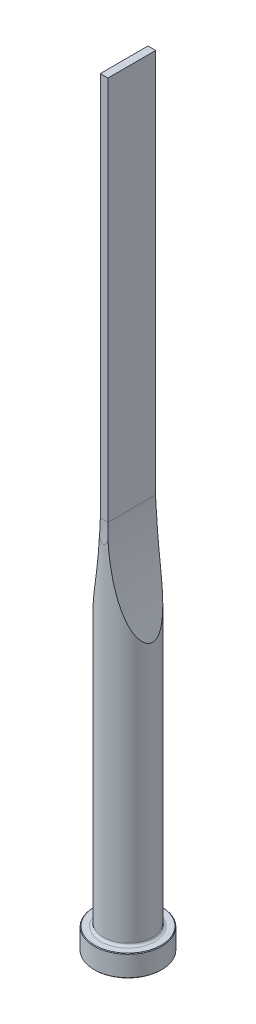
from build123d import *

# Parameters (mm, degrees)
CUT_EXTRUDE1_DEPTH = 10
CUT_EXTRUDE2_DEPTH = 10


with BuildPart() as part:
    # Sketch1 → Revolve1 (revolve)
    with BuildSketch(Plane.XY, mode=Mode.PRIVATE) as revolve1_sk:
        with BuildLine():
            Line((0, 0), (10.8, 0))
            Line((10.8, 0), (11, 0.2))
            Line((11, 0.2), (11, 6.8))
            Line((11, 6.8), (10.8, 7))
            Line((10.8, 7), (8.8, 7))
            ThreePointArc((8.8, 7), (8.234314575, 7.234314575), (8, 7.8))
            Line((8, 7.8), (8, 250))
            Line((8, 250), (0, 250))
            Line((0, 250), (0, 0))
        make_face()
    revolve(revolve1_sk.sketch.rotate(Axis((0, 250, 0), (0, -1, 0)), 180), axis=Axis((0, 250, 0), (0, -1, 0)))

    # Sketch2 → Cut-Extrude1 (cut, symmetric)
    with BuildSketch(Plane.XY):
        with BuildLine():
            Line((1.25, 250), (1.25, 125))
            ThreePointArc((1.25, 125), (2.953624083, 107.571574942), (8, 90.802960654))
            Line((8, 90.802960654), (8, 250))
            Line((8, 250), (1.25, 250))
        make_face()
        with BuildLine():
            Line((-1.25, 250), (-1.25, 125))
            ThreePointArc((-1.25, 125), (-2.953624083, 107.571574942), (-8, 90.802960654))
            Line((-8, 90.802960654), (-8, 250))
            Line((-8, 250), (-1.25, 250))
        make_face()
    extrude(amount=CUT_EXTRUDE1_DEPTH, both=True, mode=Mode.SUBTRACT)

    # Sketch3 → Cut-Extrude2 (cut, symmetric)
    with BuildSketch(Plane(origin=(0, 0, 0), x_dir=(0, 0, -1), z_dir=(1, 0, 0))):
        with BuildLine():
            Line((7.75, 250), (7.75, 125))
            ThreePointArc((7.75, 125), (7.812521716, 121.645898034), (8, 118.296456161))
            Line((8, 118.296456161), (8, 250))
            Line((8, 250), (7.75, 250))
        make_face()
        with BuildLine():
            Line((-7.75, 250), (-7.75, 125))
            ThreePointArc((-7.75, 125), (-7.812521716, 121.645898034), (-8, 118.296456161))
            Line((-8, 118.296456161), (-8, 250))
            Line((-8, 250), (-7.75, 250))
        make_face()
    extrude(amount=CUT_EXTRUDE2_DEPTH, both=True, mode=Mode.SUBTRACT)


solid = part.part
